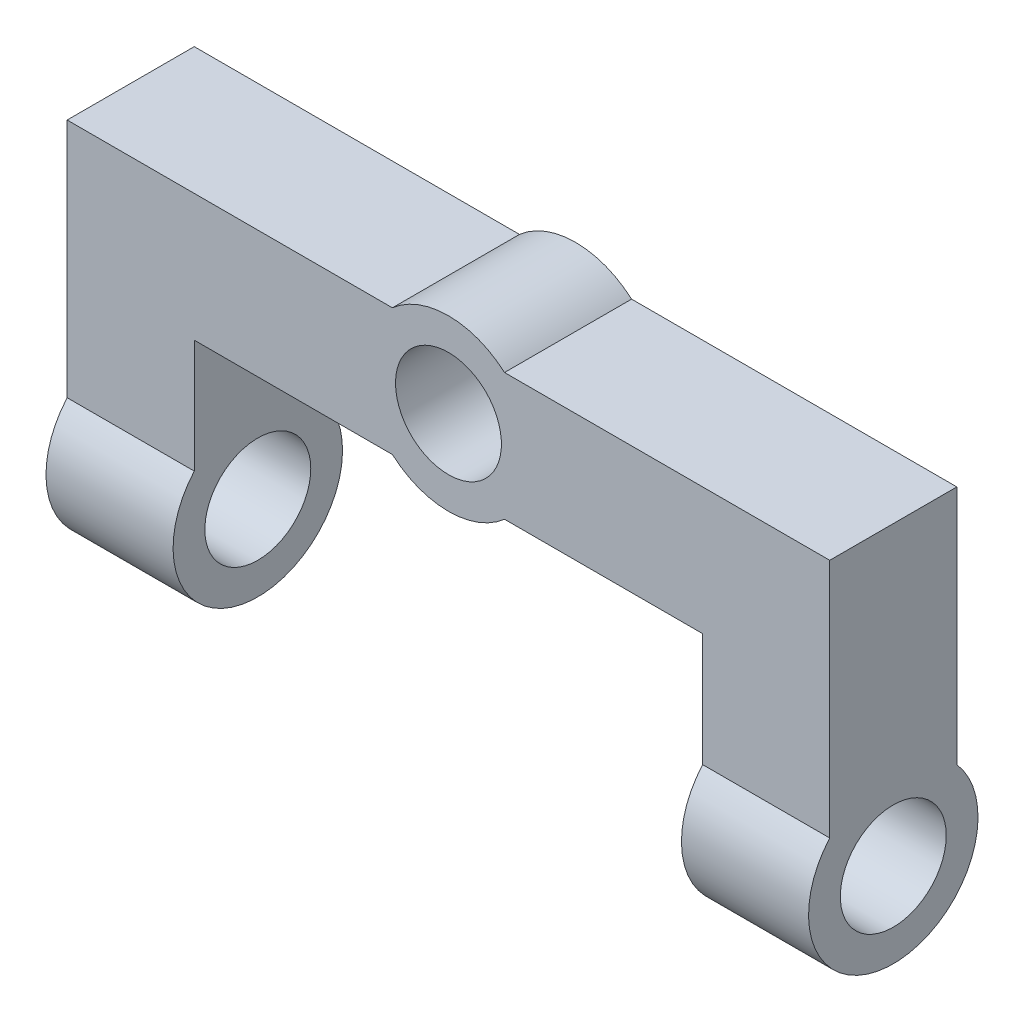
ISO-10303-21;
HEADER;
FILE_DESCRIPTION(('STEP AP214'),'2;1');
FILE_NAME('part.step','',(''),(''),'','','');
FILE_SCHEMA(('AUTOMOTIVE_DESIGN { 1 0 10303 214 1 1 1 1 }'));
ENDSEC;
DATA;
#1=APPLICATION_CONTEXT('core data for automotive mechanical design processes');
#2=APPLICATION_PROTOCOL_DEFINITION('international standard','automotive_design',2000,#1);
#3=PRODUCT_CONTEXT('',#1,'mechanical');
#4=PRODUCT('Part','Part','',(#3));
#5=PRODUCT_RELATED_PRODUCT_CATEGORY('part','',(#4));
#6=PRODUCT_DEFINITION_FORMATION('','',#4);
#7=PRODUCT_DEFINITION_CONTEXT('part definition',#1,'design');
#8=PRODUCT_DEFINITION('design','',#6,#7);
#9=PRODUCT_DEFINITION_SHAPE('','',#8);
#10=(LENGTH_UNIT() NAMED_UNIT(*) SI_UNIT(.MILLI.,.METRE.));
#11=(NAMED_UNIT(*) PLANE_ANGLE_UNIT() SI_UNIT($,.RADIAN.));
#12=(NAMED_UNIT(*) SI_UNIT($,.STERADIAN.) SOLID_ANGLE_UNIT());
#13=UNCERTAINTY_MEASURE_WITH_UNIT(LENGTH_MEASURE(1.E-05),#10,'distance_accuracy_value','');
#14=(GEOMETRIC_REPRESENTATION_CONTEXT(3) GLOBAL_UNCERTAINTY_ASSIGNED_CONTEXT((#13)) GLOBAL_UNIT_ASSIGNED_CONTEXT((#10,
#11,#12)) REPRESENTATION_CONTEXT('',''));
#15=CARTESIAN_POINT('',(0.,0.,0.));
#16=DIRECTION('',(0.,0.,1.));
#17=DIRECTION('',(1.,0.,0.));
#18=AXIS2_PLACEMENT_3D('',#15,#16,#17);
#19=CARTESIAN_POINT('',(30.,8.,6.));
#20=DIRECTION('',(0.,1.,0.));
#21=DIRECTION('',(-1.,0.,0.));
#22=AXIS2_PLACEMENT_3D('',#19,#20,#21);
#23=PLANE('',#22);
#24=DIRECTION('',(1.,0.,0.));
#25=VECTOR('',#24,1.);
#26=CARTESIAN_POINT('',(30.,8.,6.));
#27=LINE('',#26,#25);
#28=CARTESIAN_POINT('',(20.6457513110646,8.,6.));
#29=VERTEX_POINT('',#28);
#30=CARTESIAN_POINT('',(30.,8.,6.));
#31=VERTEX_POINT('',#30);
#32=EDGE_CURVE('E179',#29,#31,#27,.T.);
#33=ORIENTED_EDGE('',*,*,#32,.F.);
#34=DIRECTION('',(0.,0.,-1.));
#35=VECTOR('',#34,1.);
#36=CARTESIAN_POINT('',(20.6457513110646,8.,6.));
#37=LINE('',#36,#35);
#38=CARTESIAN_POINT('',(20.6457513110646,8.,0.));
#39=VERTEX_POINT('',#38);
#40=EDGE_CURVE('E149',#29,#39,#37,.T.);
#41=ORIENTED_EDGE('',*,*,#40,.T.);
#42=DIRECTION('',(1.,0.,0.));
#43=VECTOR('',#42,1.);
#44=CARTESIAN_POINT('',(30.,8.,0.));
#45=LINE('',#44,#43);
#46=CARTESIAN_POINT('',(30.,8.,0.));
#47=VERTEX_POINT('',#46);
#48=EDGE_CURVE('E169',#39,#47,#45,.T.);
#49=ORIENTED_EDGE('',*,*,#48,.T.);
#50=DIRECTION('',(0.,0.,-1.));
#51=VECTOR('',#50,1.);
#52=CARTESIAN_POINT('',(30.,8.,6.));
#53=LINE('',#52,#51);
#54=EDGE_CURVE('E198',#31,#47,#53,.T.);
#55=ORIENTED_EDGE('',*,*,#54,.F.);
#56=EDGE_LOOP('',(#33,#41,#49,#55));
#57=FACE_BOUND('',#56,.T.);
#58=ADVANCED_FACE('F26',(#57),#23,.F.);
#59=CARTESIAN_POINT('',(0.,14.,6.));
#60=DIRECTION('',(0.,-1.,0.));
#61=DIRECTION('',(0.,0.,-1.));
#62=AXIS2_PLACEMENT_3D('',#59,#60,#61);
#63=PLANE('',#62);
#64=DIRECTION('',(-1.,0.,0.));
#65=VECTOR('',#64,1.);
#66=CARTESIAN_POINT('',(0.,14.,6.));
#67=LINE('',#66,#65);
#68=CARTESIAN_POINT('',(15.3542486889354,14.,6.));
#69=VERTEX_POINT('',#68);
#70=CARTESIAN_POINT('',(0.,14.,6.));
#71=VERTEX_POINT('',#70);
#72=EDGE_CURVE('E41',#69,#71,#67,.T.);
#73=ORIENTED_EDGE('',*,*,#72,.F.);
#74=DIRECTION('',(0.,0.,-1.));
#75=VECTOR('',#74,1.);
#76=CARTESIAN_POINT('',(15.3542486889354,14.,6.));
#77=LINE('',#76,#75);
#78=CARTESIAN_POINT('',(15.3542486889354,14.,0.));
#79=VERTEX_POINT('',#78);
#80=EDGE_CURVE('E128',#69,#79,#77,.T.);
#81=ORIENTED_EDGE('',*,*,#80,.T.);
#82=DIRECTION('',(-1.,0.,0.));
#83=VECTOR('',#82,1.);
#84=CARTESIAN_POINT('',(0.,14.,0.));
#85=LINE('',#84,#83);
#86=CARTESIAN_POINT('',(0.,14.,0.));
#87=VERTEX_POINT('',#86);
#88=EDGE_CURVE('E116',#79,#87,#85,.T.);
#89=ORIENTED_EDGE('',*,*,#88,.T.);
#90=DIRECTION('',(0.,0.,-1.));
#91=VECTOR('',#90,1.);
#92=CARTESIAN_POINT('',(0.,14.,6.));
#93=LINE('',#92,#91);
#94=EDGE_CURVE('E193',#71,#87,#93,.T.);
#95=ORIENTED_EDGE('',*,*,#94,.F.);
#96=EDGE_LOOP('',(#73,#81,#89,#95));
#97=FACE_BOUND('',#96,.T.);
#98=ADVANCED_FACE('F129',(#97),#63,.F.);
#99=CARTESIAN_POINT('',(6.,8.,6.));
#100=DIRECTION('',(-1.,0.,0.));
#101=DIRECTION('',(0.,-1.,0.));
#102=AXIS2_PLACEMENT_3D('',#99,#100,#101);
#103=PLANE('',#102);
#104=CARTESIAN_POINT('',(6.,0.,3.));
#105=DIRECTION('',(-1.,0.,0.));
#106=DIRECTION('',(0.,-1.,0.));
#107=AXIS2_PLACEMENT_3D('',#104,#105,#106);
#108=CIRCLE('',#107,2.5);
#109=CARTESIAN_POINT('',(6.,-2.49999999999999,3.));
#110=VERTEX_POINT('',#109);
#111=EDGE_CURVE('E269',#110,#110,#108,.T.);
#112=ORIENTED_EDGE('',*,*,#111,.T.);
#113=EDGE_LOOP('',(#112));
#114=FACE_BOUND('',#113,.T.);
#115=DIRECTION('',(0.,1.,0.));
#116=VECTOR('',#115,1.);
#117=CARTESIAN_POINT('',(6.,8.,6.));
#118=LINE('',#117,#116);
#119=CARTESIAN_POINT('',(6.,2.64575131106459,6.));
#120=VERTEX_POINT('',#119);
#121=CARTESIAN_POINT('',(6.,8.,6.));
#122=VERTEX_POINT('',#121);
#123=EDGE_CURVE('E177',#120,#122,#118,.T.);
#124=ORIENTED_EDGE('',*,*,#123,.F.);
#125=CARTESIAN_POINT('',(6.,0.,3.));
#126=DIRECTION('',(-1.,0.,0.));
#127=DIRECTION('',(0.,0.,1.));
#128=AXIS2_PLACEMENT_3D('',#125,#126,#127);
#129=CIRCLE('',#128,4.);
#130=CARTESIAN_POINT('',(6.,2.64575131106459,0.));
#131=VERTEX_POINT('',#130);
#132=EDGE_CURVE('E155',#131,#120,#129,.T.);
#133=ORIENTED_EDGE('',*,*,#132,.F.);
#134=DIRECTION('',(0.,1.,0.));
#135=VECTOR('',#134,1.);
#136=CARTESIAN_POINT('',(6.,8.,0.));
#137=LINE('',#136,#135);
#138=CARTESIAN_POINT('',(6.,8.,0.));
#139=VERTEX_POINT('',#138);
#140=EDGE_CURVE('E167',#131,#139,#137,.T.);
#141=ORIENTED_EDGE('',*,*,#140,.T.);
#142=DIRECTION('',(0.,0.,-1.));
#143=VECTOR('',#142,1.);
#144=CARTESIAN_POINT('',(6.,8.,6.));
#145=LINE('',#144,#143);
#146=EDGE_CURVE('E201',#122,#139,#145,.T.);
#147=ORIENTED_EDGE('',*,*,#146,.F.);
#148=EDGE_LOOP('',(#124,#133,#141,#147));
#149=FACE_BOUND('',#148,.T.);
#150=ADVANCED_FACE('F28',(#114,#149),#103,.F.);
#151=CARTESIAN_POINT('',(15.3542486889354,8.,0.));
#152=VERTEX_POINT('',#151);
#153=EDGE_CURVE('E170',#139,#152,#45,.T.);
#154=ORIENTED_EDGE('',*,*,#153,.T.);
#155=DIRECTION('',(0.,0.,-1.));
#156=VECTOR('',#155,1.);
#157=CARTESIAN_POINT('',(15.3542486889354,8.,6.));
#158=LINE('',#157,#156);
#159=CARTESIAN_POINT('',(15.3542486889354,8.,6.));
#160=VERTEX_POINT('',#159);
#161=EDGE_CURVE('E133',#152,#160,#158,.F.);
#162=ORIENTED_EDGE('',*,*,#161,.T.);
#163=EDGE_CURVE('E180',#122,#160,#27,.T.);
#164=ORIENTED_EDGE('',*,*,#163,.F.);
#165=ORIENTED_EDGE('',*,*,#146,.T.);
#166=EDGE_LOOP('',(#154,#162,#164,#165));
#167=FACE_BOUND('',#166,.T.);
#168=ADVANCED_FACE('F231',(#167),#23,.F.);
#169=CARTESIAN_POINT('',(30.,0.,6.));
#170=DIRECTION('',(1.,0.,0.));
#171=DIRECTION('',(0.,0.,-1.));
#172=AXIS2_PLACEMENT_3D('',#169,#170,#171);
#173=PLANE('',#172);
#174=CARTESIAN_POINT('',(30.,0.,3.));
#175=DIRECTION('',(1.,0.,0.));
#176=DIRECTION('',(0.,0.,-1.));
#177=AXIS2_PLACEMENT_3D('',#174,#175,#176);
#178=CIRCLE('',#177,2.5);
#179=CARTESIAN_POINT('',(30.,0.,0.5));
#180=VERTEX_POINT('',#179);
#181=EDGE_CURVE('E272',#180,#180,#178,.T.);
#182=ORIENTED_EDGE('',*,*,#181,.T.);
#183=EDGE_LOOP('',(#182));
#184=FACE_BOUND('',#183,.T.);
#185=DIRECTION('',(0.,-1.,0.));
#186=VECTOR('',#185,1.);
#187=CARTESIAN_POINT('',(30.,0.,0.));
#188=LINE('',#187,#186);
#189=CARTESIAN_POINT('',(30.,2.6457513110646,0.));
#190=VERTEX_POINT('',#189);
#191=EDGE_CURVE('E172',#47,#190,#188,.T.);
#192=ORIENTED_EDGE('',*,*,#191,.T.);
#193=CARTESIAN_POINT('',(30.,0.,3.));
#194=DIRECTION('',(1.,0.,0.));
#195=DIRECTION('',(0.,0.,-1.));
#196=AXIS2_PLACEMENT_3D('',#193,#194,#195);
#197=CIRCLE('',#196,4.);
#198=CARTESIAN_POINT('',(30.,2.6457513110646,6.));
#199=VERTEX_POINT('',#198);
#200=EDGE_CURVE('E162',#199,#190,#197,.T.);
#201=ORIENTED_EDGE('',*,*,#200,.F.);
#202=DIRECTION('',(0.,-1.,0.));
#203=VECTOR('',#202,1.);
#204=CARTESIAN_POINT('',(30.,0.,6.));
#205=LINE('',#204,#203);
#206=EDGE_CURVE('E183',#31,#199,#205,.T.);
#207=ORIENTED_EDGE('',*,*,#206,.F.);
#208=ORIENTED_EDGE('',*,*,#54,.T.);
#209=EDGE_LOOP('',(#192,#201,#207,#208));
#210=FACE_BOUND('',#209,.T.);
#211=ADVANCED_FACE('F219',(#184,#210),#173,.F.);
#212=CARTESIAN_POINT('',(36.,14.,6.));
#213=DIRECTION('',(-1.,0.,0.));
#214=DIRECTION('',(0.,0.,1.));
#215=AXIS2_PLACEMENT_3D('',#212,#213,#214);
#216=PLANE('',#215);
#217=CARTESIAN_POINT('',(36.,0.,3.));
#218=DIRECTION('',(1.,0.,0.));
#219=DIRECTION('',(0.,0.,-1.));
#220=AXIS2_PLACEMENT_3D('',#217,#218,#219);
#221=CIRCLE('',#220,2.5);
#222=CARTESIAN_POINT('',(36.,0.,0.5));
#223=VERTEX_POINT('',#222);
#224=EDGE_CURVE('E281',#223,#223,#221,.T.);
#225=ORIENTED_EDGE('',*,*,#224,.F.);
#226=EDGE_LOOP('',(#225));
#227=FACE_BOUND('',#226,.T.);
#228=DIRECTION('',(0.,1.,0.));
#229=VECTOR('',#228,1.);
#230=CARTESIAN_POINT('',(36.,14.,6.));
#231=LINE('',#230,#229);
#232=CARTESIAN_POINT('',(36.,2.6457513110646,6.));
#233=VERTEX_POINT('',#232);
#234=CARTESIAN_POINT('',(36.,14.,6.));
#235=VERTEX_POINT('',#234);
#236=EDGE_CURVE('E186',#233,#235,#231,.T.);
#237=ORIENTED_EDGE('',*,*,#236,.F.);
#238=CARTESIAN_POINT('',(36.,0.,3.));
#239=DIRECTION('',(1.,0.,0.));
#240=DIRECTION('',(0.,0.,-1.));
#241=AXIS2_PLACEMENT_3D('',#238,#239,#240);
#242=CIRCLE('',#241,4.);
#243=CARTESIAN_POINT('',(36.,2.6457513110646,0.));
#244=VERTEX_POINT('',#243);
#245=EDGE_CURVE('E160',#233,#244,#242,.T.);
#246=ORIENTED_EDGE('',*,*,#245,.T.);
#247=DIRECTION('',(0.,1.,0.));
#248=VECTOR('',#247,1.);
#249=CARTESIAN_POINT('',(36.,14.,0.));
#250=LINE('',#249,#248);
#251=CARTESIAN_POINT('',(36.,14.,0.));
#252=VERTEX_POINT('',#251);
#253=EDGE_CURVE('E126',#244,#252,#250,.T.);
#254=ORIENTED_EDGE('',*,*,#253,.T.);
#255=DIRECTION('',(0.,0.,-1.));
#256=VECTOR('',#255,1.);
#257=CARTESIAN_POINT('',(36.,14.,6.));
#258=LINE('',#257,#256);
#259=EDGE_CURVE('E195',#235,#252,#258,.T.);
#260=ORIENTED_EDGE('',*,*,#259,.F.);
#261=EDGE_LOOP('',(#237,#246,#254,#260));
#262=FACE_BOUND('',#261,.T.);
#263=ADVANCED_FACE('F213',(#227,#262),#216,.F.);
#264=CARTESIAN_POINT('',(20.6457513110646,14.,0.));
#265=VERTEX_POINT('',#264);
#266=EDGE_CURVE('E125',#252,#265,#85,.T.);
#267=ORIENTED_EDGE('',*,*,#266,.T.);
#268=DIRECTION('',(0.,0.,-1.));
#269=VECTOR('',#268,1.);
#270=CARTESIAN_POINT('',(20.6457513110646,14.,6.));
#271=LINE('',#270,#269);
#272=CARTESIAN_POINT('',(20.6457513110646,14.,6.));
#273=VERTEX_POINT('',#272);
#274=EDGE_CURVE('E49',#265,#273,#271,.F.);
#275=ORIENTED_EDGE('',*,*,#274,.T.);
#276=EDGE_CURVE('E188',#235,#273,#67,.T.);
#277=ORIENTED_EDGE('',*,*,#276,.F.);
#278=ORIENTED_EDGE('',*,*,#259,.T.);
#279=EDGE_LOOP('',(#267,#275,#277,#278));
#280=FACE_BOUND('',#279,.T.);
#281=ADVANCED_FACE('F214',(#280),#63,.F.);
#282=CARTESIAN_POINT('',(0.,0.,6.));
#283=DIRECTION('',(1.,0.,0.));
#284=DIRECTION('',(0.,0.,-1.));
#285=AXIS2_PLACEMENT_3D('',#282,#283,#284);
#286=PLANE('',#285);
#287=CARTESIAN_POINT('',(0.,0.,3.));
#288=DIRECTION('',(1.,0.,0.));
#289=DIRECTION('',(0.,0.,-1.));
#290=AXIS2_PLACEMENT_3D('',#287,#288,#289);
#291=CIRCLE('',#290,2.5);
#292=CARTESIAN_POINT('',(0.,0.,0.5));
#293=VERTEX_POINT('',#292);
#294=EDGE_CURVE('E276',#293,#293,#291,.T.);
#295=ORIENTED_EDGE('',*,*,#294,.T.);
#296=EDGE_LOOP('',(#295));
#297=FACE_BOUND('',#296,.T.);
#298=DIRECTION('',(0.,-1.,0.));
#299=VECTOR('',#298,1.);
#300=CARTESIAN_POINT('',(0.,0.,0.));
#301=LINE('',#300,#299);
#302=CARTESIAN_POINT('',(0.,2.64575131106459,0.));
#303=VERTEX_POINT('',#302);
#304=EDGE_CURVE('E123',#87,#303,#301,.T.);
#305=ORIENTED_EDGE('',*,*,#304,.T.);
#306=CARTESIAN_POINT('',(0.,0.,3.));
#307=DIRECTION('',(-1.,0.,0.));
#308=DIRECTION('',(0.,0.,1.));
#309=AXIS2_PLACEMENT_3D('',#306,#307,#308);
#310=CIRCLE('',#309,4.);
#311=CARTESIAN_POINT('',(0.,2.64575131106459,6.));
#312=VERTEX_POINT('',#311);
#313=EDGE_CURVE('E152',#303,#312,#310,.T.);
#314=ORIENTED_EDGE('',*,*,#313,.T.);
#315=DIRECTION('',(0.,-1.,0.));
#316=VECTOR('',#315,1.);
#317=CARTESIAN_POINT('',(0.,0.,6.));
#318=LINE('',#317,#316);
#319=EDGE_CURVE('E190',#71,#312,#318,.T.);
#320=ORIENTED_EDGE('',*,*,#319,.F.);
#321=ORIENTED_EDGE('',*,*,#94,.T.);
#322=EDGE_LOOP('',(#305,#314,#320,#321));
#323=FACE_BOUND('',#322,.T.);
#324=ADVANCED_FACE('F239',(#297,#323),#286,.F.);
#325=CARTESIAN_POINT('',(0.,0.,6.));
#326=DIRECTION('',(0.,0.,-1.));
#327=DIRECTION('',(-1.,0.,0.));
#328=AXIS2_PLACEMENT_3D('',#325,#326,#327);
#329=PLANE('',#328);
#330=CARTESIAN_POINT('',(18.,11.,6.));
#331=DIRECTION('',(0.,0.,-1.));
#332=DIRECTION('',(-1.,0.,0.));
#333=AXIS2_PLACEMENT_3D('',#330,#331,#332);
#334=CIRCLE('',#333,2.5);
#335=CARTESIAN_POINT('',(15.5,11.,6.));
#336=VERTEX_POINT('',#335);
#337=EDGE_CURVE('E143',#336,#336,#334,.T.);
#338=ORIENTED_EDGE('',*,*,#337,.T.);
#339=EDGE_LOOP('',(#338));
#340=FACE_BOUND('',#339,.T.);
#341=ORIENTED_EDGE('',*,*,#163,.T.);
#342=CARTESIAN_POINT('',(18.,11.,6.));
#343=DIRECTION('',(0.,0.,-1.));
#344=DIRECTION('',(-1.,0.,0.));
#345=AXIS2_PLACEMENT_3D('',#342,#343,#344);
#346=CIRCLE('',#345,4.);
#347=EDGE_CURVE('E136',#29,#160,#346,.T.);
#348=ORIENTED_EDGE('',*,*,#347,.F.);
#349=ORIENTED_EDGE('',*,*,#32,.T.);
#350=ORIENTED_EDGE('',*,*,#206,.T.);
#351=DIRECTION('',(1.,0.,0.));
#352=VECTOR('',#351,1.);
#353=CARTESIAN_POINT('',(30.,2.6457513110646,6.));
#354=LINE('',#353,#352);
#355=EDGE_CURVE('E164',#199,#233,#354,.T.);
#356=ORIENTED_EDGE('',*,*,#355,.T.);
#357=ORIENTED_EDGE('',*,*,#236,.T.);
#358=ORIENTED_EDGE('',*,*,#276,.T.);
#359=EDGE_CURVE('E140',#69,#273,#346,.T.);
#360=ORIENTED_EDGE('',*,*,#359,.F.);
#361=ORIENTED_EDGE('',*,*,#72,.T.);
#362=ORIENTED_EDGE('',*,*,#319,.T.);
#363=DIRECTION('',(-1.,0.,0.));
#364=VECTOR('',#363,1.);
#365=CARTESIAN_POINT('',(6.,2.64575131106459,6.));
#366=LINE('',#365,#364);
#367=EDGE_CURVE('E157',#312,#120,#366,.F.);
#368=ORIENTED_EDGE('',*,*,#367,.T.);
#369=ORIENTED_EDGE('',*,*,#123,.T.);
#370=EDGE_LOOP('',(#341,#348,#349,#350,#356,#357,#358,#360,#361,#362,#368,#369));
#371=FACE_BOUND('',#370,.T.);
#372=ADVANCED_FACE('F216',(#340,#371),#329,.F.);
#373=CARTESIAN_POINT('',(0.,0.,0.));
#374=DIRECTION('',(0.,0.,-1.));
#375=DIRECTION('',(-1.,0.,0.));
#376=AXIS2_PLACEMENT_3D('',#373,#374,#375);
#377=PLANE('',#376);
#378=CARTESIAN_POINT('',(18.,11.,0.));
#379=DIRECTION('',(0.,0.,-1.));
#380=DIRECTION('',(-1.,0.,0.));
#381=AXIS2_PLACEMENT_3D('',#378,#379,#380);
#382=CIRCLE('',#381,2.5);
#383=CARTESIAN_POINT('',(15.5,11.,0.));
#384=VERTEX_POINT('',#383);
#385=EDGE_CURVE('E271',#384,#384,#382,.T.);
#386=ORIENTED_EDGE('',*,*,#385,.F.);
#387=EDGE_LOOP('',(#386));
#388=FACE_BOUND('',#387,.T.);
#389=ORIENTED_EDGE('',*,*,#88,.F.);
#390=CARTESIAN_POINT('',(18.,11.,0.));
#391=DIRECTION('',(0.,0.,-1.));
#392=DIRECTION('',(-1.,0.,0.));
#393=AXIS2_PLACEMENT_3D('',#390,#391,#392);
#394=CIRCLE('',#393,4.);
#395=EDGE_CURVE('E120',#79,#265,#394,.T.);
#396=ORIENTED_EDGE('',*,*,#395,.T.);
#397=ORIENTED_EDGE('',*,*,#266,.F.);
#398=ORIENTED_EDGE('',*,*,#253,.F.);
#399=DIRECTION('',(1.,0.,0.));
#400=VECTOR('',#399,1.);
#401=CARTESIAN_POINT('',(30.,2.6457513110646,0.));
#402=LINE('',#401,#400);
#403=EDGE_CURVE('E34',#190,#244,#402,.T.);
#404=ORIENTED_EDGE('',*,*,#403,.F.);
#405=ORIENTED_EDGE('',*,*,#191,.F.);
#406=ORIENTED_EDGE('',*,*,#48,.F.);
#407=EDGE_CURVE('E137',#39,#152,#394,.T.);
#408=ORIENTED_EDGE('',*,*,#407,.T.);
#409=ORIENTED_EDGE('',*,*,#153,.F.);
#410=ORIENTED_EDGE('',*,*,#140,.F.);
#411=DIRECTION('',(-1.,0.,0.));
#412=VECTOR('',#411,1.);
#413=CARTESIAN_POINT('',(6.,2.64575131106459,0.));
#414=LINE('',#413,#412);
#415=EDGE_CURVE('E11',#303,#131,#414,.F.);
#416=ORIENTED_EDGE('',*,*,#415,.F.);
#417=ORIENTED_EDGE('',*,*,#304,.F.);
#418=EDGE_LOOP('',(#389,#396,#397,#398,#404,#405,#406,#408,#409,#410,#416,#417));
#419=FACE_BOUND('',#418,.T.);
#420=ADVANCED_FACE('F117',(#388,#419),#377,.T.);
#421=CARTESIAN_POINT('',(30.,0.,3.));
#422=DIRECTION('',(1.,0.,0.));
#423=DIRECTION('',(0.,0.,-1.));
#424=AXIS2_PLACEMENT_3D('',#421,#422,#423);
#425=CYLINDRICAL_SURFACE('',#424,4.);
#426=ORIENTED_EDGE('',*,*,#355,.F.);
#427=ORIENTED_EDGE('',*,*,#200,.T.);
#428=ORIENTED_EDGE('',*,*,#403,.T.);
#429=ORIENTED_EDGE('',*,*,#245,.F.);
#430=EDGE_LOOP('',(#426,#427,#428,#429));
#431=FACE_BOUND('',#430,.T.);
#432=ADVANCED_FACE('F207',(#431),#425,.T.);
#433=CARTESIAN_POINT('',(6.,0.,3.));
#434=DIRECTION('',(-1.,0.,0.));
#435=DIRECTION('',(0.,0.,1.));
#436=AXIS2_PLACEMENT_3D('',#433,#434,#435);
#437=CYLINDRICAL_SURFACE('',#436,4.);
#438=ORIENTED_EDGE('',*,*,#367,.F.);
#439=ORIENTED_EDGE('',*,*,#313,.F.);
#440=ORIENTED_EDGE('',*,*,#415,.T.);
#441=ORIENTED_EDGE('',*,*,#132,.T.);
#442=EDGE_LOOP('',(#438,#439,#440,#441));
#443=FACE_BOUND('',#442,.T.);
#444=ADVANCED_FACE('F241',(#443),#437,.T.);
#445=CARTESIAN_POINT('',(18.,11.,6.));
#446=DIRECTION('',(0.,0.,-1.));
#447=DIRECTION('',(-1.,0.,0.));
#448=AXIS2_PLACEMENT_3D('',#445,#446,#447);
#449=CYLINDRICAL_SURFACE('',#448,4.);
#450=ORIENTED_EDGE('',*,*,#80,.F.);
#451=ORIENTED_EDGE('',*,*,#359,.T.);
#452=ORIENTED_EDGE('',*,*,#274,.F.);
#453=ORIENTED_EDGE('',*,*,#395,.F.);
#454=EDGE_LOOP('',(#450,#451,#452,#453));
#455=FACE_BOUND('',#454,.T.);
#456=ADVANCED_FACE('F135',(#455),#449,.T.);
#457=ORIENTED_EDGE('',*,*,#40,.F.);
#458=ORIENTED_EDGE('',*,*,#347,.T.);
#459=ORIENTED_EDGE('',*,*,#161,.F.);
#460=ORIENTED_EDGE('',*,*,#407,.F.);
#461=EDGE_LOOP('',(#457,#458,#459,#460));
#462=FACE_BOUND('',#461,.T.);
#463=ADVANCED_FACE('F228',(#462),#449,.T.);
#464=CARTESIAN_POINT('',(18.,11.,7.));
#465=DIRECTION('',(0.,0.,-1.));
#466=DIRECTION('',(-1.,0.,0.));
#467=AXIS2_PLACEMENT_3D('',#464,#465,#466);
#468=CYLINDRICAL_SURFACE('',#467,2.5);
#469=ORIENTED_EDGE('',*,*,#385,.T.);
#470=EDGE_LOOP('',(#469));
#471=FACE_BOUND('',#470,.T.);
#472=ORIENTED_EDGE('',*,*,#337,.F.);
#473=EDGE_LOOP('',(#472));
#474=FACE_BOUND('',#473,.T.);
#475=ADVANCED_FACE('F305',(#471,#474),#468,.F.);
#476=CARTESIAN_POINT('',(0.,0.,3.));
#477=DIRECTION('',(1.,0.,0.));
#478=DIRECTION('',(0.,0.,-1.));
#479=AXIS2_PLACEMENT_3D('',#476,#477,#478);
#480=CYLINDRICAL_SURFACE('',#479,2.5);
#481=ORIENTED_EDGE('',*,*,#294,.F.);
#482=EDGE_LOOP('',(#481));
#483=FACE_BOUND('',#482,.T.);
#484=ORIENTED_EDGE('',*,*,#111,.F.);
#485=EDGE_LOOP('',(#484));
#486=FACE_BOUND('',#485,.T.);
#487=ADVANCED_FACE('F307',(#483,#486),#480,.F.);
#488=ORIENTED_EDGE('',*,*,#224,.T.);
#489=EDGE_LOOP('',(#488));
#490=FACE_BOUND('',#489,.T.);
#491=ORIENTED_EDGE('',*,*,#181,.F.);
#492=EDGE_LOOP('',(#491));
#493=FACE_BOUND('',#492,.T.);
#494=ADVANCED_FACE('F285',(#490,#493),#480,.F.);
#495=CLOSED_SHELL('',(#58,#98,#150,#168,#211,#263,#281,#324,#372,#420,#432,#444,#456,#463,#475,
#487,#494));
#496=MANIFOLD_SOLID_BREP('B2',#495);
#497=ADVANCED_BREP_SHAPE_REPRESENTATION('',(#18,#496),#14);
#498=SHAPE_DEFINITION_REPRESENTATION(#9,#497);
ENDSEC;
END-ISO-10303-21;
